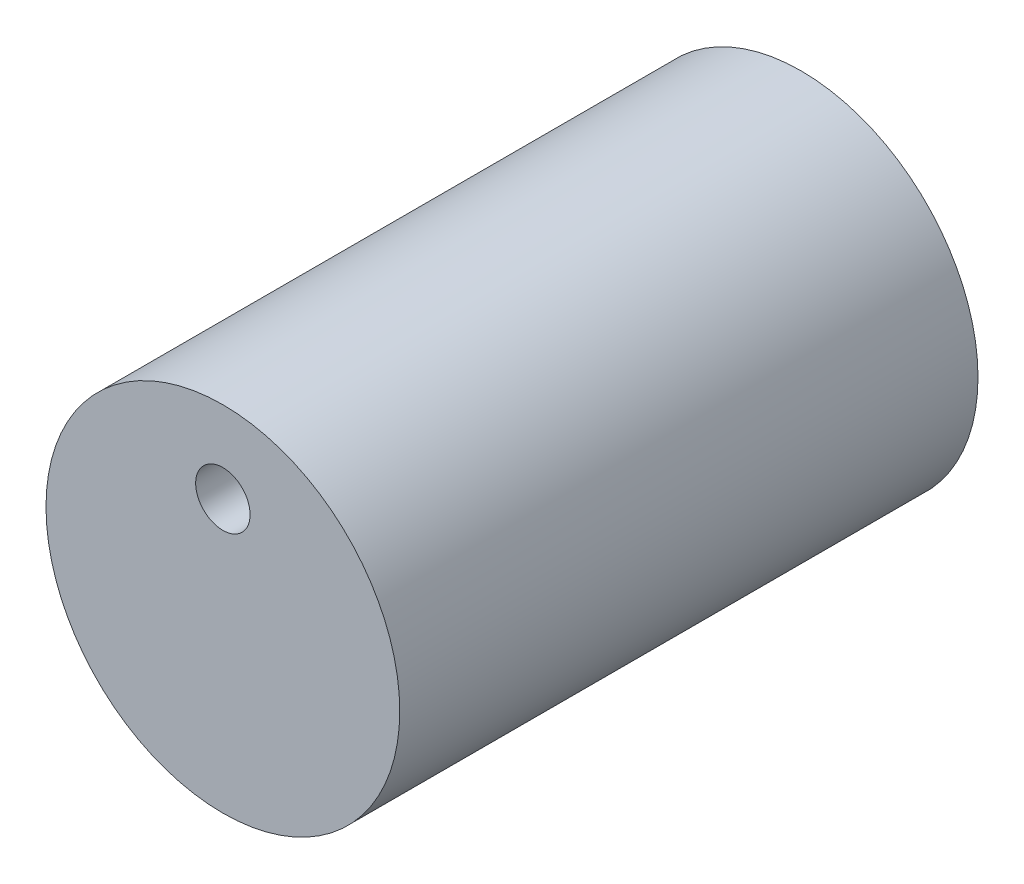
ISO-10303-21;
HEADER;
FILE_DESCRIPTION(('STEP AP214'),'2;1');
FILE_NAME('part.step','',(''),(''),'','','');
FILE_SCHEMA(('AUTOMOTIVE_DESIGN { 1 0 10303 214 1 1 1 1 }'));
ENDSEC;
DATA;
#1=APPLICATION_CONTEXT('core data for automotive mechanical design processes');
#2=APPLICATION_PROTOCOL_DEFINITION('international standard','automotive_design',2000,#1);
#3=PRODUCT_CONTEXT('',#1,'mechanical');
#4=PRODUCT('Part','Part','',(#3));
#5=PRODUCT_RELATED_PRODUCT_CATEGORY('part','',(#4));
#6=PRODUCT_DEFINITION_FORMATION('','',#4);
#7=PRODUCT_DEFINITION_CONTEXT('part definition',#1,'design');
#8=PRODUCT_DEFINITION('design','',#6,#7);
#9=PRODUCT_DEFINITION_SHAPE('','',#8);
#10=(LENGTH_UNIT() NAMED_UNIT(*) SI_UNIT(.MILLI.,.METRE.));
#11=(NAMED_UNIT(*) PLANE_ANGLE_UNIT() SI_UNIT($,.RADIAN.));
#12=(NAMED_UNIT(*) SI_UNIT($,.STERADIAN.) SOLID_ANGLE_UNIT());
#13=UNCERTAINTY_MEASURE_WITH_UNIT(LENGTH_MEASURE(1.E-05),#10,'distance_accuracy_value','');
#14=(GEOMETRIC_REPRESENTATION_CONTEXT(3) GLOBAL_UNCERTAINTY_ASSIGNED_CONTEXT((#13)) GLOBAL_UNIT_ASSIGNED_CONTEXT((#10,
#11,#12)) REPRESENTATION_CONTEXT('',''));
#15=CARTESIAN_POINT('',(0.,0.,0.));
#16=DIRECTION('',(0.,0.,1.));
#17=DIRECTION('',(1.,0.,0.));
#18=AXIS2_PLACEMENT_3D('',#15,#16,#17);
#19=CARTESIAN_POINT('',(0.,0.,42.5));
#20=DIRECTION('',(0.,0.,-1.));
#21=DIRECTION('',(-1.,0.,0.));
#22=AXIS2_PLACEMENT_3D('',#19,#20,#21);
#23=CYLINDRICAL_SURFACE('',#22,13.);
#24=CARTESIAN_POINT('',(0.,0.,42.5));
#25=DIRECTION('',(0.,0.,1.));
#26=DIRECTION('',(1.,0.,0.));
#27=AXIS2_PLACEMENT_3D('',#24,#25,#26);
#28=CIRCLE('',#27,13.);
#29=CARTESIAN_POINT('',(13.,0.,42.5));
#30=VERTEX_POINT('',#29);
#31=EDGE_CURVE('E10',#30,#30,#28,.T.);
#32=ORIENTED_EDGE('',*,*,#31,.F.);
#33=EDGE_LOOP('',(#32));
#34=FACE_BOUND('',#33,.T.);
#35=CARTESIAN_POINT('',(0.,0.,0.));
#36=DIRECTION('',(0.,0.,1.));
#37=DIRECTION('',(1.,0.,0.));
#38=AXIS2_PLACEMENT_3D('',#35,#36,#37);
#39=CIRCLE('',#38,13.);
#40=CARTESIAN_POINT('',(13.,0.,0.));
#41=VERTEX_POINT('',#40);
#42=EDGE_CURVE('E35',#41,#41,#39,.T.);
#43=ORIENTED_EDGE('',*,*,#42,.T.);
#44=EDGE_LOOP('',(#43));
#45=FACE_BOUND('',#44,.T.);
#46=ADVANCED_FACE('F32',(#34,#45),#23,.T.);
#47=CARTESIAN_POINT('',(0.,0.,42.5));
#48=DIRECTION('',(0.,0.,1.));
#49=DIRECTION('',(1.,0.,0.));
#50=AXIS2_PLACEMENT_3D('',#47,#48,#49);
#51=PLANE('',#50);
#52=CARTESIAN_POINT('',(0.,7.,42.5));
#53=DIRECTION('',(0.,0.,1.));
#54=DIRECTION('',(1.,0.,0.));
#55=AXIS2_PLACEMENT_3D('',#52,#53,#54);
#56=CIRCLE('',#55,2.);
#57=CARTESIAN_POINT('',(2.,7.,42.5));
#58=VERTEX_POINT('',#57);
#59=EDGE_CURVE('E44',#58,#58,#56,.T.);
#60=ORIENTED_EDGE('',*,*,#59,.F.);
#61=EDGE_LOOP('',(#60));
#62=FACE_BOUND('',#61,.T.);
#63=ORIENTED_EDGE('',*,*,#31,.T.);
#64=EDGE_LOOP('',(#63));
#65=FACE_BOUND('',#64,.T.);
#66=ADVANCED_FACE('F69',(#62,#65),#51,.T.);
#67=CARTESIAN_POINT('',(0.,0.,0.));
#68=DIRECTION('',(0.,0.,1.));
#69=DIRECTION('',(1.,0.,0.));
#70=AXIS2_PLACEMENT_3D('',#67,#68,#69);
#71=PLANE('',#70);
#72=CARTESIAN_POINT('',(0.,6.,0.));
#73=DIRECTION('',(0.,0.,-1.));
#74=DIRECTION('',(-1.,0.,0.));
#75=AXIS2_PLACEMENT_3D('',#72,#73,#74);
#76=CIRCLE('',#75,1.5);
#77=CARTESIAN_POINT('',(-1.5,6.,0.));
#78=VERTEX_POINT('',#77);
#79=EDGE_CURVE('E50',#78,#78,#76,.T.);
#80=ORIENTED_EDGE('',*,*,#79,.F.);
#81=EDGE_LOOP('',(#80));
#82=FACE_BOUND('',#81,.T.);
#83=ORIENTED_EDGE('',*,*,#42,.F.);
#84=EDGE_LOOP('',(#83));
#85=FACE_BOUND('',#84,.T.);
#86=ADVANCED_FACE('F65',(#82,#85),#71,.F.);
#87=CARTESIAN_POINT('',(0.,7.,37.8));
#88=DIRECTION('',(0.,0.,1.));
#89=DIRECTION('',(1.,0.,0.));
#90=AXIS2_PLACEMENT_3D('',#87,#88,#89);
#91=CYLINDRICAL_SURFACE('',#90,2.);
#92=CARTESIAN_POINT('',(0.,7.,37.8));
#93=DIRECTION('',(0.,0.,1.));
#94=DIRECTION('',(1.,0.,0.));
#95=AXIS2_PLACEMENT_3D('',#92,#93,#94);
#96=CIRCLE('',#95,2.);
#97=CARTESIAN_POINT('',(2.,7.,37.8));
#98=VERTEX_POINT('',#97);
#99=EDGE_CURVE('E42',#98,#98,#96,.T.);
#100=ORIENTED_EDGE('',*,*,#99,.F.);
#101=EDGE_LOOP('',(#100));
#102=FACE_BOUND('',#101,.T.);
#103=ORIENTED_EDGE('',*,*,#59,.T.);
#104=EDGE_LOOP('',(#103));
#105=FACE_BOUND('',#104,.T.);
#106=ADVANCED_FACE('F68',(#102,#105),#91,.F.);
#107=CARTESIAN_POINT('',(0.,7.,37.8));
#108=DIRECTION('',(0.,0.,1.));
#109=DIRECTION('',(1.,0.,0.));
#110=AXIS2_PLACEMENT_3D('',#107,#108,#109);
#111=PLANE('',#110);
#112=ORIENTED_EDGE('',*,*,#99,.T.);
#113=EDGE_LOOP('',(#112));
#114=FACE_BOUND('',#113,.T.);
#115=ADVANCED_FACE('F61',(#114),#111,.T.);
#116=CARTESIAN_POINT('',(0.,6.,4.));
#117=DIRECTION('',(0.,0.,-1.));
#118=DIRECTION('',(-1.,0.,0.));
#119=AXIS2_PLACEMENT_3D('',#116,#117,#118);
#120=CYLINDRICAL_SURFACE('',#119,1.5);
#121=CARTESIAN_POINT('',(0.,6.,4.));
#122=DIRECTION('',(0.,0.,-1.));
#123=DIRECTION('',(-1.,0.,0.));
#124=AXIS2_PLACEMENT_3D('',#121,#122,#123);
#125=CIRCLE('',#124,1.5);
#126=CARTESIAN_POINT('',(-1.5,6.,4.));
#127=VERTEX_POINT('',#126);
#128=EDGE_CURVE('E47',#127,#127,#125,.T.);
#129=ORIENTED_EDGE('',*,*,#128,.F.);
#130=EDGE_LOOP('',(#129));
#131=FACE_BOUND('',#130,.T.);
#132=ORIENTED_EDGE('',*,*,#79,.T.);
#133=EDGE_LOOP('',(#132));
#134=FACE_BOUND('',#133,.T.);
#135=ADVANCED_FACE('F58',(#131,#134),#120,.F.);
#136=CARTESIAN_POINT('',(0.,6.,4.));
#137=DIRECTION('',(0.,0.,-1.));
#138=DIRECTION('',(-1.,0.,0.));
#139=AXIS2_PLACEMENT_3D('',#136,#137,#138);
#140=PLANE('',#139);
#141=ORIENTED_EDGE('',*,*,#128,.T.);
#142=EDGE_LOOP('',(#141));
#143=FACE_BOUND('',#142,.T.);
#144=ADVANCED_FACE('F56',(#143),#140,.T.);
#145=CLOSED_SHELL('',(#46,#66,#86,#106,#115,#135,#144));
#146=MANIFOLD_SOLID_BREP('B2',#145);
#147=ADVANCED_BREP_SHAPE_REPRESENTATION('',(#18,#146),#14);
#148=SHAPE_DEFINITION_REPRESENTATION(#9,#147);
ENDSEC;
END-ISO-10303-21;
